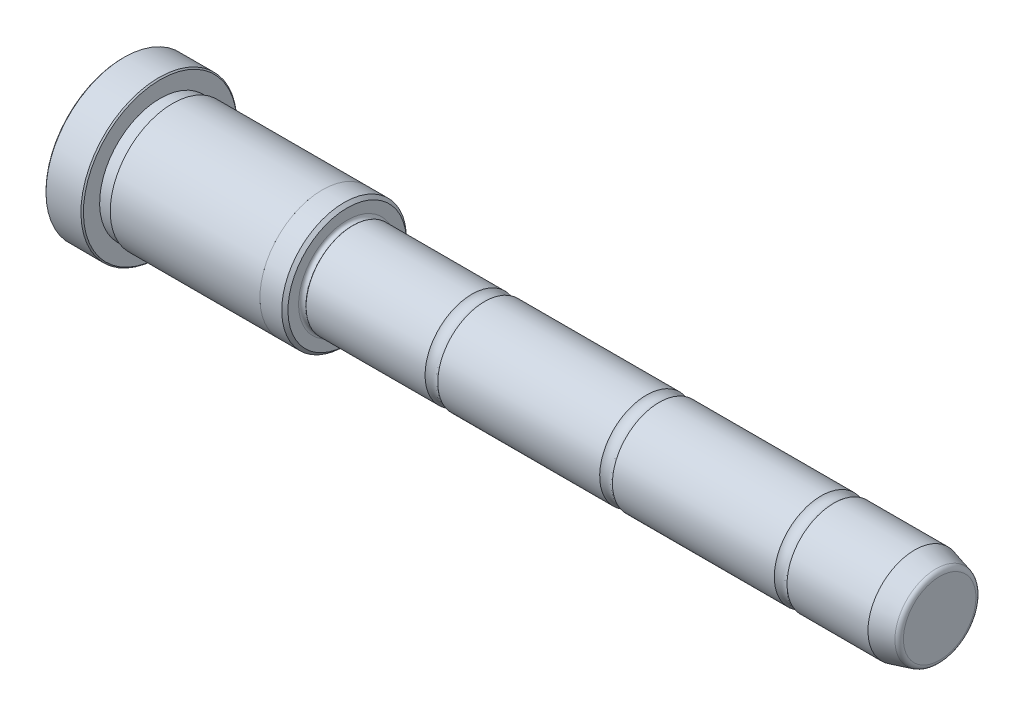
ISO-10303-21;
HEADER;
FILE_DESCRIPTION(('STEP AP214'),'2;1');
FILE_NAME('part.step','',(''),(''),'','','');
FILE_SCHEMA(('AUTOMOTIVE_DESIGN { 1 0 10303 214 1 1 1 1 }'));
ENDSEC;
DATA;
#1=APPLICATION_CONTEXT('core data for automotive mechanical design processes');
#2=APPLICATION_PROTOCOL_DEFINITION('international standard','automotive_design',2000,#1);
#3=PRODUCT_CONTEXT('',#1,'mechanical');
#4=PRODUCT('Part','Part','',(#3));
#5=PRODUCT_RELATED_PRODUCT_CATEGORY('part','',(#4));
#6=PRODUCT_DEFINITION_FORMATION('','',#4);
#7=PRODUCT_DEFINITION_CONTEXT('part definition',#1,'design');
#8=PRODUCT_DEFINITION('design','',#6,#7);
#9=PRODUCT_DEFINITION_SHAPE('','',#8);
#10=(LENGTH_UNIT() NAMED_UNIT(*) SI_UNIT(.MILLI.,.METRE.));
#11=(NAMED_UNIT(*) PLANE_ANGLE_UNIT() SI_UNIT($,.RADIAN.));
#12=(NAMED_UNIT(*) SI_UNIT($,.STERADIAN.) SOLID_ANGLE_UNIT());
#13=UNCERTAINTY_MEASURE_WITH_UNIT(LENGTH_MEASURE(1.E-05),#10,'distance_accuracy_value','');
#14=(GEOMETRIC_REPRESENTATION_CONTEXT(3) GLOBAL_UNCERTAINTY_ASSIGNED_CONTEXT((#13)) GLOBAL_UNIT_ASSIGNED_CONTEXT((#10,
#11,#12)) REPRESENTATION_CONTEXT('',''));
#15=CARTESIAN_POINT('',(0.,0.,0.));
#16=DIRECTION('',(0.,0.,1.));
#17=DIRECTION('',(1.,0.,0.));
#18=AXIS2_PLACEMENT_3D('',#15,#16,#17);
#19=CARTESIAN_POINT('',(95.,0.,0.));
#20=DIRECTION('',(1.,0.,0.));
#21=DIRECTION('',(0.,1.,0.));
#22=AXIS2_PLACEMENT_3D('',#19,#20,#21);
#23=CYLINDRICAL_SURFACE('',#22,7.49999999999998);
#24=CARTESIAN_POINT('',(0.899999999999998,0.,0.));
#25=DIRECTION('',(1.,0.,0.));
#26=DIRECTION('',(0.,1.,0.));
#27=AXIS2_PLACEMENT_3D('',#24,#25,#26);
#28=CIRCLE('',#27,7.49999999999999);
#29=CARTESIAN_POINT('',(0.899999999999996,7.5,0.));
#30=VERTEX_POINT('',#29);
#31=EDGE_CURVE('E63',#30,#30,#28,.T.);
#32=ORIENTED_EDGE('',*,*,#31,.T.);
#33=EDGE_LOOP('',(#32));
#34=FACE_BOUND('',#33,.T.);
#35=CARTESIAN_POINT('',(19.9801960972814,0.,0.));
#36=DIRECTION('',(-1.,0.,0.));
#37=DIRECTION('',(0.,-1.,0.));
#38=AXIS2_PLACEMENT_3D('',#35,#36,#37);
#39=CIRCLE('',#38,7.49999999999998);
#40=CARTESIAN_POINT('',(19.9801960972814,-7.49999999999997,0.));
#41=VERTEX_POINT('',#40);
#42=EDGE_CURVE('E99',#41,#41,#39,.T.);
#43=ORIENTED_EDGE('',*,*,#42,.T.);
#44=EDGE_LOOP('',(#43));
#45=FACE_BOUND('',#44,.T.);
#46=ADVANCED_FACE('F28',(#34,#45),#23,.T.);
#47=CARTESIAN_POINT('',(0.5,0.,0.));
#48=DIRECTION('',(1.,0.,0.));
#49=DIRECTION('',(0.,1.,0.));
#50=AXIS2_PLACEMENT_3D('',#47,#48,#49);
#51=TOROIDAL_SURFACE('',#50,7.79999999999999,0.5);
#52=CARTESIAN_POINT('',(0.,0.,0.));
#53=DIRECTION('',(1.,0.,0.));
#54=DIRECTION('',(0.,1.,0.));
#55=AXIS2_PLACEMENT_3D('',#52,#53,#54);
#56=CIRCLE('',#55,7.79999999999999);
#57=CARTESIAN_POINT('',(0.,7.8,0.));
#58=VERTEX_POINT('',#57);
#59=EDGE_CURVE('E66',#58,#58,#56,.T.);
#60=ORIENTED_EDGE('',*,*,#59,.T.);
#61=EDGE_LOOP('',(#60));
#62=FACE_BOUND('',#61,.T.);
#63=ORIENTED_EDGE('',*,*,#31,.F.);
#64=EDGE_LOOP('',(#63));
#65=FACE_BOUND('',#64,.T.);
#66=ADVANCED_FACE('F122',(#62,#65),#51,.F.);
#67=CARTESIAN_POINT('',(0.,7.8,0.));
#68=DIRECTION('',(1.,0.,0.));
#69=DIRECTION('',(0.,1.,0.));
#70=AXIS2_PLACEMENT_3D('',#67,#68,#69);
#71=PLANE('',#70);
#72=CARTESIAN_POINT('',(0.,0.,0.));
#73=DIRECTION('',(1.,0.,0.));
#74=DIRECTION('',(0.,1.,0.));
#75=AXIS2_PLACEMENT_3D('',#72,#73,#74);
#76=CIRCLE('',#75,9.49999999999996);
#77=CARTESIAN_POINT('',(0.,9.49999999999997,0.));
#78=VERTEX_POINT('',#77);
#79=EDGE_CURVE('E35',#78,#78,#76,.T.);
#80=ORIENTED_EDGE('',*,*,#79,.T.);
#81=EDGE_LOOP('',(#80));
#82=FACE_BOUND('',#81,.T.);
#83=ORIENTED_EDGE('',*,*,#59,.F.);
#84=EDGE_LOOP('',(#83));
#85=FACE_BOUND('',#84,.T.);
#86=ADVANCED_FACE('F130',(#82,#85),#71,.T.);
#87=CARTESIAN_POINT('',(95.,0.,0.));
#88=DIRECTION('',(1.,0.,0.));
#89=DIRECTION('',(0.,1.,0.));
#90=AXIS2_PLACEMENT_3D('',#87,#88,#89);
#91=CYLINDRICAL_SURFACE('',#90,9.99999999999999);
#92=CARTESIAN_POINT('',(-0.500000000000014,0.,0.));
#93=DIRECTION('',(1.,0.,0.));
#94=DIRECTION('',(0.,1.,0.));
#95=AXIS2_PLACEMENT_3D('',#92,#93,#94);
#96=CIRCLE('',#95,9.99999999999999);
#97=CARTESIAN_POINT('',(-0.500000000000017,10.,0.));
#98=VERTEX_POINT('',#97);
#99=EDGE_CURVE('E10',#98,#98,#96,.F.);
#100=ORIENTED_EDGE('',*,*,#99,.T.);
#101=EDGE_LOOP('',(#100));
#102=FACE_BOUND('',#101,.T.);
#103=CARTESIAN_POINT('',(-4.,0.,0.));
#104=DIRECTION('',(1.,0.,0.));
#105=DIRECTION('',(0.,1.,0.));
#106=AXIS2_PLACEMENT_3D('',#103,#104,#105);
#107=CIRCLE('',#106,9.99999999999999);
#108=CARTESIAN_POINT('',(-4.00000000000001,10.,0.));
#109=VERTEX_POINT('',#108);
#110=EDGE_CURVE('E69',#109,#109,#107,.T.);
#111=ORIENTED_EDGE('',*,*,#110,.T.);
#112=EDGE_LOOP('',(#111));
#113=FACE_BOUND('',#112,.T.);
#114=ADVANCED_FACE('F190',(#102,#113),#91,.T.);
#115=CARTESIAN_POINT('',(-4.,10.001,0.));
#116=DIRECTION('',(1.,0.,0.));
#117=DIRECTION('',(0.,1.,0.));
#118=AXIS2_PLACEMENT_3D('',#115,#116,#117);
#119=PLANE('',#118);
#120=CARTESIAN_POINT('',(-4.,0.,0.));
#121=DIRECTION('',(1.,0.,0.));
#122=DIRECTION('',(0.,1.,0.));
#123=AXIS2_PLACEMENT_3D('',#120,#121,#122);
#124=CIRCLE('',#123,10.001);
#125=CARTESIAN_POINT('',(-4.00000000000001,10.001,0.));
#126=VERTEX_POINT('',#125);
#127=EDGE_CURVE('E72',#126,#126,#124,.T.);
#128=ORIENTED_EDGE('',*,*,#127,.T.);
#129=EDGE_LOOP('',(#128));
#130=FACE_BOUND('',#129,.T.);
#131=ORIENTED_EDGE('',*,*,#110,.F.);
#132=EDGE_LOOP('',(#131));
#133=FACE_BOUND('',#132,.T.);
#134=ADVANCED_FACE('F186',(#130,#133),#119,.T.);
#135=CARTESIAN_POINT('',(95.,0.,0.));
#136=DIRECTION('',(1.,0.,0.));
#137=DIRECTION('',(0.,1.,0.));
#138=AXIS2_PLACEMENT_3D('',#135,#136,#137);
#139=CYLINDRICAL_SURFACE('',#138,10.001);
#140=CARTESIAN_POINT('',(-28.,0.,0.));
#141=DIRECTION('',(1.,0.,0.));
#142=DIRECTION('',(0.,1.,0.));
#143=AXIS2_PLACEMENT_3D('',#140,#141,#142);
#144=CIRCLE('',#143,10.001);
#145=CARTESIAN_POINT('',(-28.,10.001,0.));
#146=VERTEX_POINT('',#145);
#147=EDGE_CURVE('E75',#146,#146,#144,.T.);
#148=ORIENTED_EDGE('',*,*,#147,.T.);
#149=EDGE_LOOP('',(#148));
#150=FACE_BOUND('',#149,.T.);
#151=ORIENTED_EDGE('',*,*,#127,.F.);
#152=EDGE_LOOP('',(#151));
#153=FACE_BOUND('',#152,.T.);
#154=ADVANCED_FACE('F182',(#150,#153),#139,.T.);
#155=CARTESIAN_POINT('',(-28.,10.001,0.));
#156=DIRECTION('',(-1.,0.,0.));
#157=DIRECTION('',(0.,-1.,0.));
#158=AXIS2_PLACEMENT_3D('',#155,#156,#157);
#159=PLANE('',#158);
#160=CARTESIAN_POINT('',(-28.,0.,0.));
#161=DIRECTION('',(1.,0.,0.));
#162=DIRECTION('',(0.,1.,0.));
#163=AXIS2_PLACEMENT_3D('',#160,#161,#162);
#164=CIRCLE('',#163,9.69999999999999);
#165=CARTESIAN_POINT('',(-28.,9.69999999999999,0.));
#166=VERTEX_POINT('',#165);
#167=EDGE_CURVE('E78',#166,#166,#164,.T.);
#168=ORIENTED_EDGE('',*,*,#167,.T.);
#169=EDGE_LOOP('',(#168));
#170=FACE_BOUND('',#169,.T.);
#171=ORIENTED_EDGE('',*,*,#147,.F.);
#172=EDGE_LOOP('',(#171));
#173=FACE_BOUND('',#172,.T.);
#174=ADVANCED_FACE('F178',(#170,#173),#159,.T.);
#175=CARTESIAN_POINT('',(95.,0.,0.));
#176=DIRECTION('',(1.,0.,0.));
#177=DIRECTION('',(0.,1.,0.));
#178=AXIS2_PLACEMENT_3D('',#175,#176,#177);
#179=CYLINDRICAL_SURFACE('',#178,9.69999999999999);
#180=CARTESIAN_POINT('',(-30.,0.,0.));
#181=DIRECTION('',(1.,0.,0.));
#182=DIRECTION('',(0.,1.,0.));
#183=AXIS2_PLACEMENT_3D('',#180,#181,#182);
#184=CIRCLE('',#183,9.69999999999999);
#185=CARTESIAN_POINT('',(-30.,9.69999999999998,0.));
#186=VERTEX_POINT('',#185);
#187=EDGE_CURVE('E81',#186,#186,#184,.T.);
#188=ORIENTED_EDGE('',*,*,#187,.T.);
#189=EDGE_LOOP('',(#188));
#190=FACE_BOUND('',#189,.T.);
#191=ORIENTED_EDGE('',*,*,#167,.F.);
#192=EDGE_LOOP('',(#191));
#193=FACE_BOUND('',#192,.T.);
#194=ADVANCED_FACE('F174',(#190,#193),#179,.T.);
#195=CARTESIAN_POINT('',(-30.,9.69999999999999,0.));
#196=DIRECTION('',(1.,0.,0.));
#197=DIRECTION('',(0.,1.,0.));
#198=AXIS2_PLACEMENT_3D('',#195,#196,#197);
#199=PLANE('',#198);
#200=CARTESIAN_POINT('',(-30.,0.,0.));
#201=DIRECTION('',(1.,0.,0.));
#202=DIRECTION('',(0.,1.,0.));
#203=AXIS2_PLACEMENT_3D('',#200,#201,#202);
#204=CIRCLE('',#203,12.2999999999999);
#205=CARTESIAN_POINT('',(-30.,12.2999999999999,0.));
#206=VERTEX_POINT('',#205);
#207=EDGE_CURVE('E39',#206,#206,#204,.T.);
#208=ORIENTED_EDGE('',*,*,#207,.T.);
#209=EDGE_LOOP('',(#208));
#210=FACE_BOUND('',#209,.T.);
#211=ORIENTED_EDGE('',*,*,#187,.F.);
#212=EDGE_LOOP('',(#211));
#213=FACE_BOUND('',#212,.T.);
#214=ADVANCED_FACE('F170',(#210,#213),#199,.T.);
#215=CARTESIAN_POINT('',(95.,0.,0.));
#216=DIRECTION('',(1.,0.,0.));
#217=DIRECTION('',(0.,1.,0.));
#218=AXIS2_PLACEMENT_3D('',#215,#216,#217);
#219=CYLINDRICAL_SURFACE('',#218,12.5);
#220=CARTESIAN_POINT('',(-35.8,0.,0.));
#221=DIRECTION('',(-1.,0.,0.));
#222=DIRECTION('',(0.,-1.,0.));
#223=AXIS2_PLACEMENT_3D('',#220,#221,#222);
#224=CIRCLE('',#223,12.5);
#225=CARTESIAN_POINT('',(-35.8,-12.5,0.));
#226=VERTEX_POINT('',#225);
#227=EDGE_CURVE('E48',#226,#226,#224,.F.);
#228=ORIENTED_EDGE('',*,*,#227,.T.);
#229=EDGE_LOOP('',(#228));
#230=FACE_BOUND('',#229,.T.);
#231=CARTESIAN_POINT('',(-30.2,0.,0.));
#232=DIRECTION('',(1.,0.,0.));
#233=DIRECTION('',(0.,1.,0.));
#234=AXIS2_PLACEMENT_3D('',#231,#232,#233);
#235=CIRCLE('',#234,12.5);
#236=CARTESIAN_POINT('',(-30.2,12.5,0.));
#237=VERTEX_POINT('',#236);
#238=EDGE_CURVE('E51',#237,#237,#235,.F.);
#239=ORIENTED_EDGE('',*,*,#238,.T.);
#240=EDGE_LOOP('',(#239));
#241=FACE_BOUND('',#240,.T.);
#242=ADVANCED_FACE('F117',(#230,#241),#219,.T.);
#243=CARTESIAN_POINT('',(-36.,12.5,0.));
#244=DIRECTION('',(-1.,0.,0.));
#245=DIRECTION('',(0.,-1.,0.));
#246=AXIS2_PLACEMENT_3D('',#243,#244,#245);
#247=PLANE('',#246);
#248=CARTESIAN_POINT('',(-36.,0.,0.));
#249=DIRECTION('',(-1.,0.,0.));
#250=DIRECTION('',(0.,-1.,0.));
#251=AXIS2_PLACEMENT_3D('',#248,#249,#250);
#252=CIRCLE('',#251,12.3);
#253=CARTESIAN_POINT('',(-36.,-12.3,0.));
#254=VERTEX_POINT('',#253);
#255=EDGE_CURVE('E43',#254,#254,#252,.T.);
#256=ORIENTED_EDGE('',*,*,#255,.T.);
#257=EDGE_LOOP('',(#256));
#258=FACE_BOUND('',#257,.T.);
#259=ADVANCED_FACE('F107',(#258),#247,.T.);
#260=CARTESIAN_POINT('',(21.,0.,0.));
#261=DIRECTION('',(-1.,0.,0.));
#262=DIRECTION('',(0.,-1.,0.));
#263=AXIS2_PLACEMENT_3D('',#260,#261,#262);
#264=TOROIDAL_SURFACE('',#263,8.59999999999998,1.5);
#265=CARTESIAN_POINT('',(22.0198039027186,0.,0.));
#266=DIRECTION('',(-1.,0.,0.));
#267=DIRECTION('',(0.,-1.,0.));
#268=AXIS2_PLACEMENT_3D('',#265,#266,#267);
#269=CIRCLE('',#268,7.49999999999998);
#270=CARTESIAN_POINT('',(22.0198039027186,-7.49999999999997,0.));
#271=VERTEX_POINT('',#270);
#272=EDGE_CURVE('E96',#271,#271,#269,.T.);
#273=ORIENTED_EDGE('',*,*,#272,.T.);
#274=EDGE_LOOP('',(#273));
#275=FACE_BOUND('',#274,.T.);
#276=ORIENTED_EDGE('',*,*,#42,.F.);
#277=EDGE_LOOP('',(#276));
#278=FACE_BOUND('',#277,.T.);
#279=ADVANCED_FACE('F104',(#275,#278),#264,.F.);
#280=CARTESIAN_POINT('',(95.,6.42820323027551,0.));
#281=DIRECTION('',(1.,0.,0.));
#282=DIRECTION('',(0.,1.,0.));
#283=AXIS2_PLACEMENT_3D('',#280,#281,#282);
#284=PLANE('',#283);
#285=CARTESIAN_POINT('',(95.,0.,0.));
#286=DIRECTION('',(1.,0.,0.));
#287=DIRECTION('',(0.,1.,0.));
#288=AXIS2_PLACEMENT_3D('',#285,#286,#287);
#289=CIRCLE('',#288,5.8143416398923);
#290=CARTESIAN_POINT('',(95.,5.81434163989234,0.));
#291=VERTEX_POINT('',#290);
#292=EDGE_CURVE('E57',#291,#291,#289,.T.);
#293=ORIENTED_EDGE('',*,*,#292,.T.);
#294=EDGE_LOOP('',(#293));
#295=FACE_BOUND('',#294,.T.);
#296=ADVANCED_FACE('F106',(#295),#284,.T.);
#297=CARTESIAN_POINT('',(95.,0.,0.));
#298=DIRECTION('',(-1.,0.,0.));
#299=DIRECTION('',(0.,-1.,0.));
#300=AXIS2_PLACEMENT_3D('',#297,#298,#299);
#301=CONICAL_SURFACE('',#300,6.42820323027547,0.26179938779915);
#302=CARTESIAN_POINT('',(94.407055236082,0.,0.));
#303=DIRECTION('',(1.,0.,0.));
#304=DIRECTION('',(0.,1.,0.));
#305=AXIS2_PLACEMENT_3D('',#302,#303,#304);
#306=CIRCLE('',#305,6.58708230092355);
#307=CARTESIAN_POINT('',(94.407055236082,6.58708230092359,0.));
#308=VERTEX_POINT('',#307);
#309=EDGE_CURVE('E54',#308,#308,#306,.F.);
#310=ORIENTED_EDGE('',*,*,#309,.T.);
#311=EDGE_LOOP('',(#310));
#312=FACE_BOUND('',#311,.T.);
#313=CARTESIAN_POINT('',(91.,0.,0.));
#314=DIRECTION('',(1.,0.,0.));
#315=DIRECTION('',(0.,1.,0.));
#316=AXIS2_PLACEMENT_3D('',#313,#314,#315);
#317=CIRCLE('',#316,7.49999999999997);
#318=CARTESIAN_POINT('',(91.,7.5,0.));
#319=VERTEX_POINT('',#318);
#320=EDGE_CURVE('E60',#319,#319,#317,.T.);
#321=ORIENTED_EDGE('',*,*,#320,.T.);
#322=EDGE_LOOP('',(#321));
#323=FACE_BOUND('',#322,.T.);
#324=ADVANCED_FACE('F114',(#312,#323),#301,.T.);
#325=ORIENTED_EDGE('',*,*,#320,.F.);
#326=EDGE_LOOP('',(#325));
#327=FACE_BOUND('',#326,.T.);
#328=CARTESIAN_POINT('',(78.0198039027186,0.,0.));
#329=DIRECTION('',(-1.,0.,0.));
#330=DIRECTION('',(0.,-1.,0.));
#331=AXIS2_PLACEMENT_3D('',#328,#329,#330);
#332=CIRCLE('',#331,7.49999999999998);
#333=CARTESIAN_POINT('',(78.0198039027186,-7.49999999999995,0.));
#334=VERTEX_POINT('',#333);
#335=EDGE_CURVE('E84',#334,#334,#332,.T.);
#336=ORIENTED_EDGE('',*,*,#335,.F.);
#337=EDGE_LOOP('',(#336));
#338=FACE_BOUND('',#337,.T.);
#339=ADVANCED_FACE('F126',(#327,#338),#23,.T.);
#340=CARTESIAN_POINT('',(77.,0.,0.));
#341=DIRECTION('',(-1.,0.,0.));
#342=DIRECTION('',(0.,-1.,0.));
#343=AXIS2_PLACEMENT_3D('',#340,#341,#342);
#344=TOROIDAL_SURFACE('',#343,8.59999999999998,1.5);
#345=ORIENTED_EDGE('',*,*,#335,.T.);
#346=EDGE_LOOP('',(#345));
#347=FACE_BOUND('',#346,.T.);
#348=CARTESIAN_POINT('',(75.9801960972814,0.,0.));
#349=DIRECTION('',(-1.,0.,0.));
#350=DIRECTION('',(0.,-1.,0.));
#351=AXIS2_PLACEMENT_3D('',#348,#349,#350);
#352=CIRCLE('',#351,7.49999999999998);
#353=CARTESIAN_POINT('',(75.9801960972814,-7.49999999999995,0.));
#354=VERTEX_POINT('',#353);
#355=EDGE_CURVE('E87',#354,#354,#352,.T.);
#356=ORIENTED_EDGE('',*,*,#355,.F.);
#357=EDGE_LOOP('',(#356));
#358=FACE_BOUND('',#357,.T.);
#359=ADVANCED_FACE('F140',(#347,#358),#344,.F.);
#360=ORIENTED_EDGE('',*,*,#355,.T.);
#361=EDGE_LOOP('',(#360));
#362=FACE_BOUND('',#361,.T.);
#363=CARTESIAN_POINT('',(50.0198039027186,0.,0.));
#364=DIRECTION('',(-1.,0.,0.));
#365=DIRECTION('',(0.,-1.,0.));
#366=AXIS2_PLACEMENT_3D('',#363,#364,#365);
#367=CIRCLE('',#366,7.49999999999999);
#368=CARTESIAN_POINT('',(50.0198039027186,-7.49999999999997,0.));
#369=VERTEX_POINT('',#368);
#370=EDGE_CURVE('E90',#369,#369,#367,.T.);
#371=ORIENTED_EDGE('',*,*,#370,.F.);
#372=EDGE_LOOP('',(#371));
#373=FACE_BOUND('',#372,.T.);
#374=ADVANCED_FACE('F138',(#362,#373),#23,.T.);
#375=CARTESIAN_POINT('',(49.,0.,0.));
#376=DIRECTION('',(-1.,0.,0.));
#377=DIRECTION('',(0.,-1.,0.));
#378=AXIS2_PLACEMENT_3D('',#375,#376,#377);
#379=TOROIDAL_SURFACE('',#378,8.59999999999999,1.5);
#380=ORIENTED_EDGE('',*,*,#370,.T.);
#381=EDGE_LOOP('',(#380));
#382=FACE_BOUND('',#381,.T.);
#383=CARTESIAN_POINT('',(47.9801960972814,0.,0.));
#384=DIRECTION('',(-1.,0.,0.));
#385=DIRECTION('',(0.,-1.,0.));
#386=AXIS2_PLACEMENT_3D('',#383,#384,#385);
#387=CIRCLE('',#386,7.49999999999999);
#388=CARTESIAN_POINT('',(47.9801960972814,-7.49999999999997,0.));
#389=VERTEX_POINT('',#388);
#390=EDGE_CURVE('E93',#389,#389,#387,.T.);
#391=ORIENTED_EDGE('',*,*,#390,.F.);
#392=EDGE_LOOP('',(#391));
#393=FACE_BOUND('',#392,.T.);
#394=ADVANCED_FACE('F136',(#382,#393),#379,.F.);
#395=ORIENTED_EDGE('',*,*,#390,.T.);
#396=EDGE_LOOP('',(#395));
#397=FACE_BOUND('',#396,.T.);
#398=ORIENTED_EDGE('',*,*,#272,.F.);
#399=EDGE_LOOP('',(#398));
#400=FACE_BOUND('',#399,.T.);
#401=ADVANCED_FACE('F125',(#397,#400),#23,.T.);
#402=CARTESIAN_POINT('',(94.2,0.,0.));
#403=DIRECTION('',(1.,0.,0.));
#404=DIRECTION('',(0.,1.,0.));
#405=AXIS2_PLACEMENT_3D('',#402,#403,#404);
#406=TOROIDAL_SURFACE('',#405,5.8143416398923,0.8);
#407=ORIENTED_EDGE('',*,*,#309,.F.);
#408=EDGE_LOOP('',(#407));
#409=FACE_BOUND('',#408,.T.);
#410=ORIENTED_EDGE('',*,*,#292,.F.);
#411=EDGE_LOOP('',(#410));
#412=FACE_BOUND('',#411,.T.);
#413=ADVANCED_FACE('F135',(#409,#412),#406,.T.);
#414=CARTESIAN_POINT('',(-35.8,0.,0.));
#415=DIRECTION('',(1.,0.,0.));
#416=DIRECTION('',(0.,1.,0.));
#417=AXIS2_PLACEMENT_3D('',#414,#415,#416);
#418=CONICAL_SURFACE('',#417,12.5,0.785398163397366);
#419=ORIENTED_EDGE('',*,*,#255,.F.);
#420=EDGE_LOOP('',(#419));
#421=FACE_BOUND('',#420,.T.);
#422=ORIENTED_EDGE('',*,*,#227,.F.);
#423=EDGE_LOOP('',(#422));
#424=FACE_BOUND('',#423,.T.);
#425=ADVANCED_FACE('F245',(#421,#424),#418,.T.);
#426=CARTESIAN_POINT('',(-30.,0.,0.));
#427=DIRECTION('',(-1.,0.,0.));
#428=DIRECTION('',(0.,-1.,0.));
#429=AXIS2_PLACEMENT_3D('',#426,#427,#428);
#430=CONICAL_SURFACE('',#429,12.2999999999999,0.785398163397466);
#431=ORIENTED_EDGE('',*,*,#238,.F.);
#432=EDGE_LOOP('',(#431));
#433=FACE_BOUND('',#432,.T.);
#434=ORIENTED_EDGE('',*,*,#207,.F.);
#435=EDGE_LOOP('',(#434));
#436=FACE_BOUND('',#435,.T.);
#437=ADVANCED_FACE('F249',(#433,#436),#430,.T.);
#438=CARTESIAN_POINT('',(0.,0.,0.));
#439=DIRECTION('',(-1.,0.,0.));
#440=DIRECTION('',(0.,-1.,0.));
#441=AXIS2_PLACEMENT_3D('',#438,#439,#440);
#442=CONICAL_SURFACE('',#441,9.49999999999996,0.785398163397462);
#443=ORIENTED_EDGE('',*,*,#99,.F.);
#444=EDGE_LOOP('',(#443));
#445=FACE_BOUND('',#444,.T.);
#446=ORIENTED_EDGE('',*,*,#79,.F.);
#447=EDGE_LOOP('',(#446));
#448=FACE_BOUND('',#447,.T.);
#449=ADVANCED_FACE('F30',(#445,#448),#442,.T.);
#450=CLOSED_SHELL('',(#46,#66,#86,#114,#134,#154,#174,#194,#214,#242,#259,#279,#296,#324,#339,
#359,#374,#394,#401,#413,#425,#437,#449));
#451=MANIFOLD_SOLID_BREP('B2',#450);
#452=ADVANCED_BREP_SHAPE_REPRESENTATION('',(#18,#451),#14);
#453=SHAPE_DEFINITION_REPRESENTATION(#9,#452);
ENDSEC;
END-ISO-10303-21;
